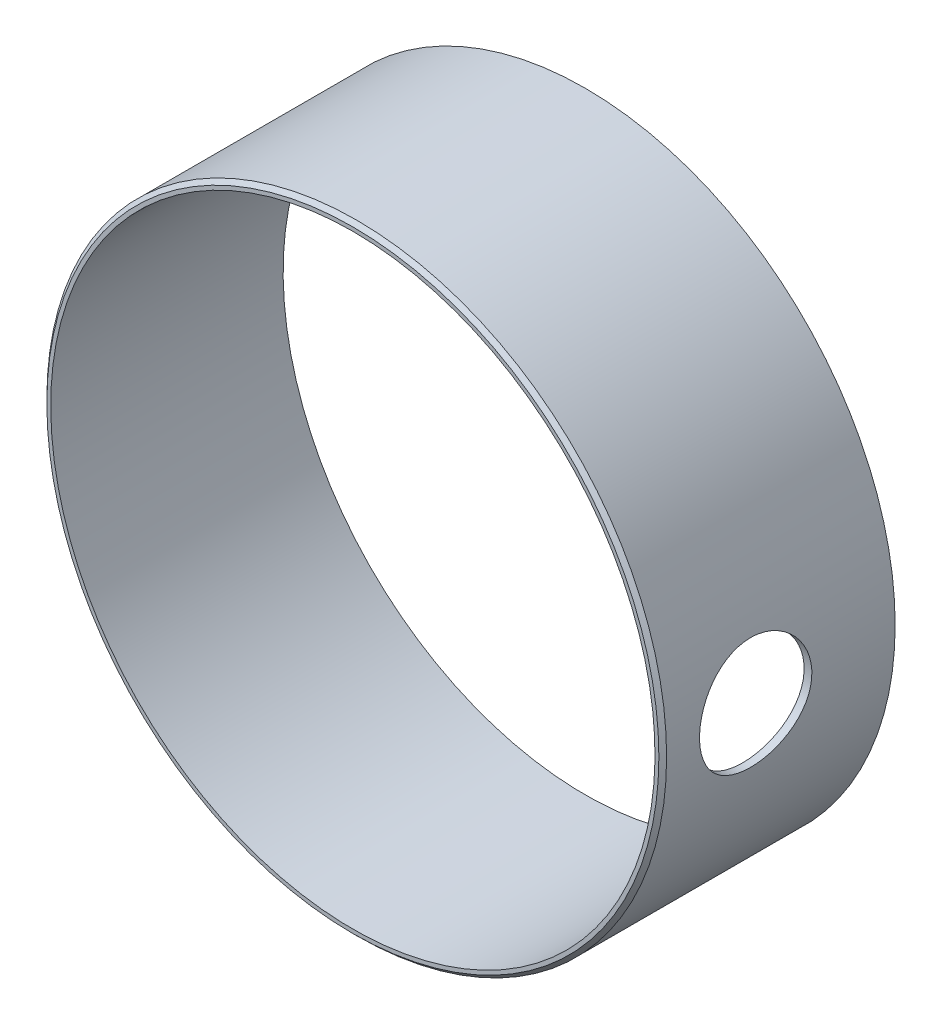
ISO-10303-21;
HEADER;
FILE_DESCRIPTION(('STEP AP214'),'2;1');
FILE_NAME('part.step','',(''),(''),'','','');
FILE_SCHEMA(('AUTOMOTIVE_DESIGN { 1 0 10303 214 1 1 1 1 }'));
ENDSEC;
DATA;
#1=APPLICATION_CONTEXT('core data for automotive mechanical design processes');
#2=APPLICATION_PROTOCOL_DEFINITION('international standard','automotive_design',2000,#1);
#3=PRODUCT_CONTEXT('',#1,'mechanical');
#4=PRODUCT('Part','Part','',(#3));
#5=PRODUCT_RELATED_PRODUCT_CATEGORY('part','',(#4));
#6=PRODUCT_DEFINITION_FORMATION('','',#4);
#7=PRODUCT_DEFINITION_CONTEXT('part definition',#1,'design');
#8=PRODUCT_DEFINITION('design','',#6,#7);
#9=PRODUCT_DEFINITION_SHAPE('','',#8);
#10=(LENGTH_UNIT() NAMED_UNIT(*) SI_UNIT(.MILLI.,.METRE.));
#11=(NAMED_UNIT(*) PLANE_ANGLE_UNIT() SI_UNIT($,.RADIAN.));
#12=(NAMED_UNIT(*) SI_UNIT($,.STERADIAN.) SOLID_ANGLE_UNIT());
#13=UNCERTAINTY_MEASURE_WITH_UNIT(LENGTH_MEASURE(1.E-05),#10,'distance_accuracy_value','');
#14=(GEOMETRIC_REPRESENTATION_CONTEXT(3) GLOBAL_UNCERTAINTY_ASSIGNED_CONTEXT((#13)) GLOBAL_UNIT_ASSIGNED_CONTEXT((#10,
#11,#12)) REPRESENTATION_CONTEXT('',''));
#15=CARTESIAN_POINT('',(0.,0.,0.));
#16=DIRECTION('',(0.,0.,1.));
#17=DIRECTION('',(1.,0.,0.));
#18=AXIS2_PLACEMENT_3D('',#15,#16,#17);
#19=CARTESIAN_POINT('',(0.,0.,0.));
#20=DIRECTION('',(0.,0.,-1.));
#21=DIRECTION('',(0.,1.,0.));
#22=AXIS2_PLACEMENT_3D('',#19,#20,#21);
#23=CYLINDRICAL_SURFACE('',#22,39.);
#24=CARTESIAN_POINT('',(38.3201970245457,7.25,18.));
#25=CARTESIAN_POINT('',(38.3201951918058,7.25000361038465,17.7982103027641));
#26=CARTESIAN_POINT('',(38.3217939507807,7.24157297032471,17.5964672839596));
#27=CARTESIAN_POINT('',(38.3281379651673,7.20792312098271,17.1943748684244));
#28=CARTESIAN_POINT('',(38.3328837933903,7.18270085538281,16.9940257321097));
#29=CARTESIAN_POINT('',(38.3453884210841,7.11564066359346,16.5961133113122));
#30=CARTESIAN_POINT('',(38.3531489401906,7.07379325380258,16.3985516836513));
#31=CARTESIAN_POINT('',(38.3714583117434,6.97379166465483,16.0076539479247));
#32=CARTESIAN_POINT('',(38.3820081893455,6.91563148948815,15.814319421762));
#33=CARTESIAN_POINT('',(38.40557336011,6.78354074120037,15.4335568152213));
#34=CARTESIAN_POINT('',(38.4185854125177,6.709630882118,15.2461213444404));
#35=CARTESIAN_POINT('',(38.4467164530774,6.54651369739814,14.8781122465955));
#36=CARTESIAN_POINT('',(38.4618362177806,6.45730073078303,14.6975411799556));
#37=CARTESIAN_POINT('',(38.4937435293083,6.26428509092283,14.3446391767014));
#38=CARTESIAN_POINT('',(38.5105302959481,6.16048923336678,14.1723044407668));
#39=CARTESIAN_POINT('',(38.5453145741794,5.93896411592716,13.8368740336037));
#40=CARTESIAN_POINT('',(38.5633125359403,5.82122966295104,13.6737818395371));
#41=CARTESIAN_POINT('',(38.6002099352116,5.57134693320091,13.3563127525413));
#42=CARTESIAN_POINT('',(38.6191169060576,5.43905909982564,13.2020465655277));
#43=CARTESIAN_POINT('',(38.657129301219,5.16196783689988,12.9051162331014));
#44=CARTESIAN_POINT('',(38.6762347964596,5.0171597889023,12.7624564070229));
#45=CARTESIAN_POINT('',(38.7140982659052,4.71610012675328,12.4898158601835));
#46=CARTESIAN_POINT('',(38.7328563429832,4.55985197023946,12.359831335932));
#47=CARTESIAN_POINT('',(38.7695155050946,4.23687230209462,12.1133459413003));
#48=CARTESIAN_POINT('',(38.787416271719,4.0701369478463,11.996850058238));
#49=CARTESIAN_POINT('',(38.8219808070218,3.72611128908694,11.7774182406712));
#50=CARTESIAN_POINT('',(38.8386345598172,3.5487526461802,11.6745878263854));
#51=CARTESIAN_POINT('',(38.8700866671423,3.18583310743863,11.4842535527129));
#52=CARTESIAN_POINT('',(38.8848850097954,3.00027215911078,11.3967497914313));
#53=CARTESIAN_POINT('',(38.9122035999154,2.62227209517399,11.2377350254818));
#54=CARTESIAN_POINT('',(38.9247240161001,2.42983349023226,11.1662228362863));
#55=CARTESIAN_POINT('',(38.9471295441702,2.03944196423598,11.0397358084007));
#56=CARTESIAN_POINT('',(38.9570146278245,1.84148898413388,10.9847611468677));
#57=CARTESIAN_POINT('',(38.9737664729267,1.44383634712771,10.8923268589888));
#58=CARTESIAN_POINT('',(38.9806669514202,1.24418366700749,10.8546712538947));
#59=CARTESIAN_POINT('',(38.9914222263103,0.842274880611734,10.7962280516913));
#60=CARTESIAN_POINT('',(38.9952759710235,0.640017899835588,10.77544627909));
#61=CARTESIAN_POINT('',(38.9998212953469,0.234511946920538,10.7509502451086));
#62=CARTESIAN_POINT('',(39.0005142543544,0.0312634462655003,10.7472285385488));
#63=CARTESIAN_POINT('',(38.9987290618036,-0.374836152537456,10.7568424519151));
#64=CARTESIAN_POINT('',(38.9962497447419,-0.577687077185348,10.7701843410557));
#65=CARTESIAN_POINT('',(38.9842252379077,-1.17827816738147,10.8351865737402));
#66=CARTESIAN_POINT('',(38.9701517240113,-1.57355865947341,10.9115022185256));
#67=CARTESIAN_POINT('',(38.9313367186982,-2.34538232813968,11.1281288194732));
#68=CARTESIAN_POINT('',(38.9065948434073,-2.72192482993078,11.2684420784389));
#69=CARTESIAN_POINT('',(38.8489741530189,-3.44828538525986,11.6098770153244));
#70=CARTESIAN_POINT('',(38.8160508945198,-3.79794334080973,11.811332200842));
#71=CARTESIAN_POINT('',(38.7457078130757,-4.45878641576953,12.2690866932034));
#72=CARTESIAN_POINT('',(38.7082875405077,-4.76996768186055,12.5253914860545));
#73=CARTESIAN_POINT('',(38.6324313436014,-5.34997432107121,13.0901581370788));
#74=CARTESIAN_POINT('',(38.5939886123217,-5.6180904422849,13.3993480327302));
#75=CARTESIAN_POINT('',(38.5209598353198,-6.09876604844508,14.0586806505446));
#76=CARTESIAN_POINT('',(38.4863738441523,-6.31132474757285,14.4088239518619));
#77=CARTESIAN_POINT('',(38.4249651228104,-6.67505038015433,15.14105500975));
#78=CARTESIAN_POINT('',(38.3981552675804,-6.82611566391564,15.5231944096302));
#79=CARTESIAN_POINT('',(38.3555326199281,-7.06169898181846,16.3080402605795));
#80=CARTESIAN_POINT('',(38.3397186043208,-7.14622441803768,16.710744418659));
#81=CARTESIAN_POINT('',(38.3211197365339,-7.24529615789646,17.5188962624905));
#82=CARTESIAN_POINT('',(38.3181452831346,-7.26086089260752,17.9242148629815));
#83=CARTESIAN_POINT('',(38.3250551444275,-7.22429800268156,18.7316599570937));
#84=CARTESIAN_POINT('',(38.3349388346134,-7.1721736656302,19.1337866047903));
#85=CARTESIAN_POINT('',(38.3662748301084,-7.00258646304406,19.9200937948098));
#86=CARTESIAN_POINT('',(38.3876327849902,-6.88565623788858,20.3043933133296));
#87=CARTESIAN_POINT('',(38.4394297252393,-6.5903396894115,21.0479457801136));
#88=CARTESIAN_POINT('',(38.4698693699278,-6.41194890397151,21.4071969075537));
#89=CARTESIAN_POINT('',(38.5368322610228,-5.99643157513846,22.0949437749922));
#90=CARTESIAN_POINT('',(38.5734206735,-5.7586609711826,22.4230438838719));
#91=CARTESIAN_POINT('',(38.6483750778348,-5.23198327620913,23.035060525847));
#92=CARTESIAN_POINT('',(38.6867412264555,-4.94307166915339,23.318973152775));
#93=CARTESIAN_POINT('',(38.7615349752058,-4.31784235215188,23.8383339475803));
#94=CARTESIAN_POINT('',(38.7979305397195,-3.98095243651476,24.0730974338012));
#95=CARTESIAN_POINT('',(38.864152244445,-3.27169519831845,24.4827419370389));
#96=CARTESIAN_POINT('',(38.8939786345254,-2.89932922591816,24.6576252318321));
#97=CARTESIAN_POINT('',(38.9311948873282,-2.32361083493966,24.8705999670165));
#98=CARTESIAN_POINT('',(38.9423311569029,-2.12926115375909,24.9332877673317));
#99=CARTESIAN_POINT('',(38.9618460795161,-1.73586099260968,25.0420773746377));
#100=CARTESIAN_POINT('',(38.9702257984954,-1.53681236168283,25.0881855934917));
#101=CARTESIAN_POINT('',(38.9839873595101,-1.13538728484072,25.1634581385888));
#102=CARTESIAN_POINT('',(38.9893683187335,-0.933009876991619,25.1926174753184));
#103=CARTESIAN_POINT('',(38.9969749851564,-0.526530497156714,25.2337383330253));
#104=CARTESIAN_POINT('',(38.9992019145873,-0.32242922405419,25.2457065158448));
#105=CARTESIAN_POINT('',(39.0004308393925,0.0830569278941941,25.2523178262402));
#106=CARTESIAN_POINT('',(38.9994797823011,0.284437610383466,25.2472131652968));
#107=CARTESIAN_POINT('',(38.9944835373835,0.68596730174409,25.2202784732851));
#108=CARTESIAN_POINT('',(38.9904394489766,0.886116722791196,25.1984543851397));
#109=CARTESIAN_POINT('',(38.9793700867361,1.28386045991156,25.1382537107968));
#110=CARTESIAN_POINT('',(38.9723443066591,1.48145433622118,25.0998743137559));
#111=CARTESIAN_POINT('',(38.9555067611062,1.87265179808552,25.0068606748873));
#112=CARTESIAN_POINT('',(38.9456950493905,2.0662554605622,24.9522267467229));
#113=CARTESIAN_POINT('',(38.9235756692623,2.44779791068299,24.8272261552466));
#114=CARTESIAN_POINT('',(38.9112723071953,2.63574583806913,24.7568866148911));
#115=CARTESIAN_POINT('',(38.8844961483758,3.00503517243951,24.6009421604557));
#116=CARTESIAN_POINT('',(38.8700233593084,3.18637660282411,24.5153373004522));
#117=CARTESIAN_POINT('',(38.8392987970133,3.54127157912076,24.3294573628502));
#118=CARTESIAN_POINT('',(38.8230466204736,3.71482334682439,24.2291789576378));
#119=CARTESIAN_POINT('',(38.7892125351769,4.05288086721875,24.0147081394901));
#120=CARTESIAN_POINT('',(38.77163108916,4.21738973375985,23.9005205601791));
#121=CARTESIAN_POINT('',(38.7353476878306,4.53865083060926,23.6572370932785));
#122=CARTESIAN_POINT('',(38.7166332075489,4.69525653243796,23.5279495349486));
#123=CARTESIAN_POINT('',(38.6788460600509,4.99699753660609,23.2567716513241));
#124=CARTESIAN_POINT('',(38.6597735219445,5.14213687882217,23.1148858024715));
#125=CARTESIAN_POINT('',(38.6217831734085,5.42010695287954,22.8193482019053));
#126=CARTESIAN_POINT('',(38.6028654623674,5.55293026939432,22.6656894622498));
#127=CARTESIAN_POINT('',(38.5657332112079,5.80521124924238,22.3477794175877));
#128=CARTESIAN_POINT('',(38.5475184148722,5.92467381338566,22.1835320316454));
#129=CARTESIAN_POINT('',(38.512131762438,6.15052042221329,21.8439014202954));
#130=CARTESIAN_POINT('',(38.4949714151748,6.2567699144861,21.6684274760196));
#131=CARTESIAN_POINT('',(38.46238830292,6.45404379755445,21.3090516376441));
#132=CARTESIAN_POINT('',(38.4469648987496,6.5450737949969,21.1251528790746));
#133=CARTESIAN_POINT('',(38.4183109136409,6.71122185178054,20.7502727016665));
#134=CARTESIAN_POINT('',(38.4050789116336,6.78635023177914,20.5592959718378));
#135=CARTESIAN_POINT('',(38.3811906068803,6.92017425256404,20.1715799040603));
#136=CARTESIAN_POINT('',(38.3705337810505,6.97887323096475,19.974841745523));
#137=CARTESIAN_POINT('',(38.347917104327,7.10231658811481,19.4861977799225));
#138=CARTESIAN_POINT('',(38.3375764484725,7.15762650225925,19.19177881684));
#139=CARTESIAN_POINT('',(38.3237178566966,7.23146504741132,18.5982056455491));
#140=CARTESIAN_POINT('',(38.3201997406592,7.2499946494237,18.2990515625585));
#141=CARTESIAN_POINT('',(38.3201970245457,7.25,18.));
#142=B_SPLINE_CURVE_WITH_KNOTS('',3,(#24,#25,#26,#27,#28,#29,#30,#31,#32,#33,#34,#35,#36,#37,
#38,#39,#40,#41,#42,#43,#44,#45,#46,#47,#48,#49,#50,#51,#52,#53,#54,#55,#56,#57,#58,#59,#60,#61,
#62,#63,#64,#65,#66,#67,#68,#69,#70,#71,#72,#73,#74,#75,#76,#77,#78,#79,#80,#81,#82,#83,#84,#85,
#86,#87,#88,#89,#90,#91,#92,#93,#94,#95,#96,#97,#98,#99,#100,#101,#102,#103,#104,#105,#106,#107,
#108,#109,#110,#111,#112,#113,#114,#115,#116,#117,#118,#119,#120,#121,#122,#123,#124,#125,#126,
#127,#128,#129,#130,#131,#132,#133,#134,#135,#136,#137,#138,#139,#140,#141),.UNSPECIFIED.,.T.,
.F.,(4,2,2,2,2,2,2,2,2,2,2,2,2,2,2,2,2,2,2,2,2,2,2,2,2,2,2,2,2,2,2,2,2,2,2,2,2,2,2,2,2,2,2,2,2,
2,2,2,2,2,2,2,2,2,2,2,2,2,4),(0.,0.605106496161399,1.21032316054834,1.81588555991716,
2.42167082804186,3.02666422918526,3.63188112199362,4.23681608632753,4.84197714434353,
5.45355284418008,6.06535511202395,6.6769732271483,7.28881676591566,7.90513977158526,
8.52146672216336,9.13774800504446,9.75403588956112,10.3631671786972,10.9725086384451,
11.5815841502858,12.1908835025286,13.393159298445,14.5954783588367,15.8044772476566,
17.0135971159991,18.2409449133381,19.4683100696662,20.6976959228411,21.9269449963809,
23.1379783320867,24.3489528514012,25.5501188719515,26.7513721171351,27.9662681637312,
29.1812715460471,30.4122148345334,31.6431112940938,32.2560386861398,32.8687287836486,
33.4815991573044,34.0942319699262,34.6978547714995,35.3012631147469,35.9047739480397,
36.5082731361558,37.110738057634,37.7132008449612,38.3158004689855,38.9181912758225,
39.5292912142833,40.1401748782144,40.751423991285,41.3624481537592,41.9792581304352,
42.5958403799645,43.2120212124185,43.8280767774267,44.7248659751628,45.6216314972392),.UNSPECIFIED.);
#143=CARTESIAN_POINT('',(38.3201970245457,7.25,18.));
#144=VERTEX_POINT('',#143);
#145=EDGE_CURVE('E48',#144,#144,#142,.T.);
#146=ORIENTED_EDGE('',*,*,#145,.F.);
#147=EDGE_LOOP('',(#146));
#148=FACE_BOUND('',#147,.T.);
#149=CARTESIAN_POINT('',(0.,0.,0.));
#150=DIRECTION('',(0.,0.,-1.));
#151=DIRECTION('',(0.,1.,0.));
#152=AXIS2_PLACEMENT_3D('',#149,#150,#151);
#153=CIRCLE('',#152,39.);
#154=CARTESIAN_POINT('',(0.,39.,0.));
#155=VERTEX_POINT('',#154);
#156=EDGE_CURVE('E54',#155,#155,#153,.T.);
#157=ORIENTED_EDGE('',*,*,#156,.T.);
#158=EDGE_LOOP('',(#157));
#159=FACE_BOUND('',#158,.T.);
#160=CARTESIAN_POINT('',(0.,0.,30.));
#161=DIRECTION('',(0.,0.,-1.));
#162=DIRECTION('',(0.,1.,0.));
#163=AXIS2_PLACEMENT_3D('',#160,#161,#162);
#164=CIRCLE('',#163,39.);
#165=CARTESIAN_POINT('',(0.,39.,30.));
#166=VERTEX_POINT('',#165);
#167=EDGE_CURVE('E27',#166,#166,#164,.T.);
#168=ORIENTED_EDGE('',*,*,#167,.F.);
#169=EDGE_LOOP('',(#168));
#170=FACE_BOUND('',#169,.T.);
#171=ADVANCED_FACE('F12',(#148,#159,#170),#23,.F.);
#172=CARTESIAN_POINT('',(39.,0.,30.));
#173=DIRECTION('',(0.,0.,1.));
#174=DIRECTION('',(0.,-1.,0.));
#175=AXIS2_PLACEMENT_3D('',#172,#173,#174);
#176=PLANE('',#175);
#177=CARTESIAN_POINT('',(0.,0.,30.));
#178=DIRECTION('',(0.,0.,1.));
#179=DIRECTION('',(0.,-1.,0.));
#180=AXIS2_PLACEMENT_3D('',#177,#178,#179);
#181=CIRCLE('',#180,39.5);
#182=CARTESIAN_POINT('',(0.,-39.5,30.));
#183=VERTEX_POINT('',#182);
#184=EDGE_CURVE('E8',#183,#183,#181,.T.);
#185=ORIENTED_EDGE('',*,*,#184,.T.);
#186=EDGE_LOOP('',(#185));
#187=FACE_BOUND('',#186,.T.);
#188=ORIENTED_EDGE('',*,*,#167,.T.);
#189=EDGE_LOOP('',(#188));
#190=FACE_BOUND('',#189,.T.);
#191=ADVANCED_FACE('F63',(#187,#190),#176,.T.);
#192=CARTESIAN_POINT('',(0.,0.,0.));
#193=DIRECTION('',(0.,0.,-1.));
#194=DIRECTION('',(0.,1.,0.));
#195=AXIS2_PLACEMENT_3D('',#192,#193,#194);
#196=CYLINDRICAL_SURFACE('',#195,40.);
#197=CARTESIAN_POINT('',(0.,0.,29.5));
#198=DIRECTION('',(0.,0.,1.));
#199=DIRECTION('',(0.,-1.,0.));
#200=AXIS2_PLACEMENT_3D('',#197,#198,#199);
#201=CIRCLE('',#200,40.);
#202=CARTESIAN_POINT('',(0.,-40.,29.5));
#203=VERTEX_POINT('',#202);
#204=EDGE_CURVE('E19',#203,#203,#201,.F.);
#205=ORIENTED_EDGE('',*,*,#204,.T.);
#206=EDGE_LOOP('',(#205));
#207=FACE_BOUND('',#206,.T.);
#208=CARTESIAN_POINT('',(39.3374821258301,7.25,18.));
#209=CARTESIAN_POINT('',(39.3374804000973,7.25000348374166,18.2018840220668));
#210=CARTESIAN_POINT('',(39.3390392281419,7.24156503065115,18.4037225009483));
#211=CARTESIAN_POINT('',(39.3452250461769,7.20788325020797,18.806006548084));
#212=CARTESIAN_POINT('',(39.3498526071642,7.18263679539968,19.0064518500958));
#213=CARTESIAN_POINT('',(39.3620459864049,7.11551062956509,19.4045604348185));
#214=CARTESIAN_POINT('',(39.3696135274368,7.07362116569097,19.602222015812));
#215=CARTESIAN_POINT('',(39.3874681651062,6.97351673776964,19.9933192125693));
#216=CARTESIAN_POINT('',(39.3977562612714,6.91529577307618,20.1867532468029));
#217=CARTESIAN_POINT('',(39.4207376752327,6.78306228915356,20.5677169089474));
#218=CARTESIAN_POINT('',(39.4334278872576,6.70907014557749,20.7552538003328));
#219=CARTESIAN_POINT('',(39.4608639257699,6.54576743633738,21.1234604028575));
#220=CARTESIAN_POINT('',(39.4756105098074,6.45645122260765,21.3041275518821));
#221=CARTESIAN_POINT('',(39.5067308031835,6.26320917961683,21.6572113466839));
#222=CARTESIAN_POINT('',(39.5231037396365,6.1592902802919,21.8296318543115));
#223=CARTESIAN_POINT('',(39.5570307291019,5.9374998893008,22.1652207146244));
#224=CARTESIAN_POINT('',(39.5745852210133,5.81962320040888,22.3283855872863));
#225=CARTESIAN_POINT('',(39.6105634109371,5.56950484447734,22.6458980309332));
#226=CARTESIAN_POINT('',(39.6289940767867,5.43713059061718,22.8001403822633));
#227=CARTESIAN_POINT('',(39.6660478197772,5.15986571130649,23.0970142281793));
#228=CARTESIAN_POINT('',(39.6846709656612,5.01497046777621,23.2396414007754));
#229=CARTESIAN_POINT('',(39.7215770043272,4.71373876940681,23.512205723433));
#230=CARTESIAN_POINT('',(39.7398599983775,4.55740579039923,23.6421467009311));
#231=CARTESIAN_POINT('',(39.7755887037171,4.2342617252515,23.8885333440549));
#232=CARTESIAN_POINT('',(39.7930341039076,4.067446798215,24.0049740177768));
#233=CARTESIAN_POINT('',(39.8267103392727,3.72333597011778,24.2242412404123));
#234=CARTESIAN_POINT('',(39.8429319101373,3.54597539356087,24.3269677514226));
#235=CARTESIAN_POINT('',(39.8735655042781,3.18306911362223,24.5170954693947));
#236=CARTESIAN_POINT('',(39.8879775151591,2.99752335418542,24.6044965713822));
#237=CARTESIAN_POINT('',(39.9145804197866,2.61957083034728,24.7633100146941));
#238=CARTESIAN_POINT('',(39.9267714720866,2.42716455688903,24.8347234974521));
#239=CARTESIAN_POINT('',(39.9485847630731,2.03685451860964,24.9610198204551));
#240=CARTESIAN_POINT('',(39.9582069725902,1.83895069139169,25.0159024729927));
#241=CARTESIAN_POINT('',(39.9745144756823,1.44130034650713,25.1081889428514));
#242=CARTESIAN_POINT('',(39.9812310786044,1.24159842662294,25.1457793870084));
#243=CARTESIAN_POINT('',(39.9916931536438,0.839600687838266,25.2040850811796));
#244=CARTESIAN_POINT('',(39.9954375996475,0.637303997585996,25.2247945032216));
#245=CARTESIAN_POINT('',(39.9998421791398,0.231726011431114,25.2491402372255));
#246=CARTESIAN_POINT('',(40.0005036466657,0.0284451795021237,25.2527839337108));
#247=CARTESIAN_POINT('',(39.9987339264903,-0.377712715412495,25.243008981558));
#248=CARTESIAN_POINT('',(39.9963016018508,-0.580589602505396,25.229584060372));
#249=CARTESIAN_POINT('',(39.9845276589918,-1.18149599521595,25.1643009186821));
#250=CARTESIAN_POINT('',(39.9707629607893,-1.57705523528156,25.0877393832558));
#251=CARTESIAN_POINT('',(39.9328225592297,-2.34939622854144,24.8705190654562));
#252=CARTESIAN_POINT('',(39.9086464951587,-2.72617733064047,24.7298580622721));
#253=CARTESIAN_POINT('',(39.8523681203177,-3.45286395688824,24.3876665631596));
#254=CARTESIAN_POINT('',(39.8202243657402,-3.80261599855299,24.1858165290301));
#255=CARTESIAN_POINT('',(39.7515686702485,-4.46356529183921,23.7272119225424));
#256=CARTESIAN_POINT('',(39.7150563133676,-4.77475886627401,23.4704521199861));
#257=CARTESIAN_POINT('',(39.6410955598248,-5.35446526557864,22.9049442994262));
#258=CARTESIAN_POINT('',(39.6036412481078,-5.62230228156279,22.5955037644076));
#259=CARTESIAN_POINT('',(39.5325199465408,-6.10237219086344,21.9357334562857));
#260=CARTESIAN_POINT('',(39.498853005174,-6.31460437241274,21.5854031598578));
#261=CARTESIAN_POINT('',(39.4391113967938,-6.67761547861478,20.8529369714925));
#262=CARTESIAN_POINT('',(39.4130482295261,-6.82830145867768,20.4707540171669));
#263=CARTESIAN_POINT('',(39.3716452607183,-7.06313732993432,19.6859187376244));
#264=CARTESIAN_POINT('',(39.3563043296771,-7.1472942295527,19.2832685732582));
#265=CARTESIAN_POINT('',(39.3383047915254,-7.24570736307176,18.475008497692));
#266=CARTESIAN_POINT('',(39.3354704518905,-7.26093225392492,18.0695203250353));
#267=CARTESIAN_POINT('',(39.3423354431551,-7.22364090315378,17.261794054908));
#268=CARTESIAN_POINT('',(39.3520341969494,-7.1711277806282,16.8595558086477));
#269=CARTESIAN_POINT('',(39.3827092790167,-7.00068127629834,16.0728984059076));
#270=CARTESIAN_POINT('',(39.4035988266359,-6.88325108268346,15.688366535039));
#271=CARTESIAN_POINT('',(39.4542276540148,-6.58683440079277,14.9444370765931));
#272=CARTESIAN_POINT('',(39.4839675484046,-6.40784363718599,14.5850412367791));
#273=CARTESIAN_POINT('',(39.5493487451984,-5.99114492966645,13.8973060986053));
#274=CARTESIAN_POINT('',(39.5850504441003,-5.75282236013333,13.5693450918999));
#275=CARTESIAN_POINT('',(39.6581610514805,-5.2250386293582,12.957716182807));
#276=CARTESIAN_POINT('',(39.6955701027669,-4.93557318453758,12.6740519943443));
#277=CARTESIAN_POINT('',(39.768440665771,-4.30947987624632,12.1554949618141));
#278=CARTESIAN_POINT('',(39.8038721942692,-3.97231057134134,11.9212520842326));
#279=CARTESIAN_POINT('',(39.8683051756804,-3.2626153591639,11.512688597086));
#280=CARTESIAN_POINT('',(39.8973068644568,-2.89009074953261,11.3383657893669));
#281=CARTESIAN_POINT('',(39.9334649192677,-2.31419662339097,11.1262238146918));
#282=CARTESIAN_POINT('',(39.9442794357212,-2.11977936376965,11.063808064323));
#283=CARTESIAN_POINT('',(39.9632162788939,-1.72627429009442,10.9555670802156));
#284=CARTESIAN_POINT('',(39.9713396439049,-1.52718830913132,10.9097354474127));
#285=CARTESIAN_POINT('',(39.9846613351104,-1.12571716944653,10.8350166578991));
#286=CARTESIAN_POINT('',(39.9898587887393,-0.923331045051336,10.8061345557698));
#287=CARTESIAN_POINT('',(39.9971766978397,-0.516861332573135,10.7655652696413));
#288=CARTESIAN_POINT('',(39.9992983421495,-0.31277843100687,10.7538714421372));
#289=CARTESIAN_POINT('',(40.0003992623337,0.0927985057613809,10.7477970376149));
#290=CARTESIAN_POINT('',(39.999422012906,0.294288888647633,10.7531769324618));
#291=CARTESIAN_POINT('',(39.9944483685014,0.696014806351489,10.7806798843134));
#292=CARTESIAN_POINT('',(39.9904530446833,0.896250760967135,10.8027970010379));
#293=CARTESIAN_POINT('',(39.9795548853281,1.29414456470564,10.8636002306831));
#294=CARTESIAN_POINT('',(39.9726515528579,1.49180196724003,10.9022891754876));
#295=CARTESIAN_POINT('',(39.9561293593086,1.88310275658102,10.9959372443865));
#296=CARTESIAN_POINT('',(39.9465105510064,2.07674622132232,11.0508960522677));
#297=CARTESIAN_POINT('',(39.9248402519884,2.45837461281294,11.176570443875));
#298=CARTESIAN_POINT('',(39.912792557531,2.64636785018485,11.2472614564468));
#299=CARTESIAN_POINT('',(39.886585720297,3.01571890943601,11.4039268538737));
#300=CARTESIAN_POINT('',(39.8724265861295,3.1970767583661,11.4899011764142));
#301=CARTESIAN_POINT('',(39.8423796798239,3.55197221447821,11.6765358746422));
#302=CARTESIAN_POINT('',(39.82649152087,3.72550805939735,11.7771995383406));
#303=CARTESIAN_POINT('',(39.7934267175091,4.06349827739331,11.9924537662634));
#304=CARTESIAN_POINT('',(39.7762505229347,4.22795578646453,12.1070394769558));
#305=CARTESIAN_POINT('',(39.7408267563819,4.5489699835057,12.351055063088));
#306=CARTESIAN_POINT('',(39.7225676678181,4.70538626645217,12.4806680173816));
#307=CARTESIAN_POINT('',(39.6857126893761,5.00672013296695,12.7524852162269));
#308=CARTESIAN_POINT('',(39.6671169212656,5.15164177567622,12.8946849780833));
#309=CARTESIAN_POINT('',(39.6300892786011,5.42914689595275,13.1908351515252));
#310=CARTESIAN_POINT('',(39.6116575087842,5.56172293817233,13.3447925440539));
#311=CARTESIAN_POINT('',(39.5754927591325,5.81347958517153,13.663279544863));
#312=CARTESIAN_POINT('',(39.5577595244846,5.93266510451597,13.8278052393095));
#313=CARTESIAN_POINT('',(39.5233318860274,6.15786765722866,14.1678821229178));
#314=CARTESIAN_POINT('',(39.5066482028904,6.26375725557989,14.343518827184));
#315=CARTESIAN_POINT('',(39.4749849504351,6.4602996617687,14.7031815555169));
#316=CARTESIAN_POINT('',(39.4600047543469,6.55095807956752,14.8872044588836));
#317=CARTESIAN_POINT('',(39.4321901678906,6.7163543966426,15.2622896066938));
#318=CARTESIAN_POINT('',(39.4193543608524,6.79110281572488,15.4533471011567));
#319=CARTESIAN_POINT('',(39.396198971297,6.92416433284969,15.8411829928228));
#320=CARTESIAN_POINT('',(39.3858788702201,6.98248081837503,16.0379602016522));
#321=CARTESIAN_POINT('',(39.3640927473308,7.10448291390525,16.524632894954));
#322=CARTESIAN_POINT('',(39.354165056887,7.15898287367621,16.8169519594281));
#323=CARTESIAN_POINT('',(39.3408610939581,7.23173841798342,17.40621357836));
#324=CARTESIAN_POINT('',(39.3374846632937,7.24999487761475,17.7031560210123));
#325=CARTESIAN_POINT('',(39.3374821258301,7.25,18.));
#326=B_SPLINE_CURVE_WITH_KNOTS('',3,(#208,#209,#210,#211,#212,#213,#214,#215,#216,#217,#218,
#219,#220,#221,#222,#223,#224,#225,#226,#227,#228,#229,#230,#231,#232,#233,#234,#235,#236,#237,
#238,#239,#240,#241,#242,#243,#244,#245,#246,#247,#248,#249,#250,#251,#252,#253,#254,#255,#256,
#257,#258,#259,#260,#261,#262,#263,#264,#265,#266,#267,#268,#269,#270,#271,#272,#273,#274,#275,
#276,#277,#278,#279,#280,#281,#282,#283,#284,#285,#286,#287,#288,#289,#290,#291,#292,#293,#294,
#295,#296,#297,#298,#299,#300,#301,#302,#303,#304,#305,#306,#307,#308,#309,#310,#311,#312,#313,
#314,#315,#316,#317,#318,#319,#320,#321,#322,#323,#324,#325),.UNSPECIFIED.,.T.,.F.,(4,2,2,2,2,2,
2,2,2,2,2,2,2,2,2,2,2,2,2,2,2,2,2,2,2,2,2,2,2,2,2,2,2,2,2,2,2,2,2,2,2,2,2,2,2,2,2,2,2,2,2,2,2,2,
2,2,2,2,4),(0.,0.605391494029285,1.2108956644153,1.81675518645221,2.4228376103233,
3.02814169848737,3.63366936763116,4.23891063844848,4.8443779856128,5.45593657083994,
6.06772168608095,6.67932165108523,7.29114704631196,7.90721640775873,8.52328998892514,
9.13931957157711,9.75535614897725,10.3645784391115,10.9740109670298,11.5831797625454,
12.1925724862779,13.3957709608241,14.5990111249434,15.8086463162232,17.0183967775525,
18.2454897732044,19.4725984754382,20.7015535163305,21.9303790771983,23.1418820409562,
24.353329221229,25.5555152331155,26.7577847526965,27.9730685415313,29.1884541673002,
30.4189451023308,31.6493908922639,32.2622104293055,32.8747932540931,33.487558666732,
34.1000871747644,34.7040606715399,35.3078199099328,35.9116823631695,36.5155330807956,
37.1184472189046,37.7213588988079,38.3244057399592,38.9272429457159,39.5384019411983,
40.1493441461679,40.7606519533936,41.3717346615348,41.9882877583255,42.604613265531,
43.2205299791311,43.83631962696,44.7264899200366,45.6166387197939),.UNSPECIFIED.);
#327=CARTESIAN_POINT('',(39.3374821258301,7.25,18.));
#328=VERTEX_POINT('',#327);
#329=EDGE_CURVE('E23',#328,#328,#326,.T.);
#330=ORIENTED_EDGE('',*,*,#329,.F.);
#331=EDGE_LOOP('',(#330));
#332=FACE_BOUND('',#331,.T.);
#333=CARTESIAN_POINT('',(0.,0.,0.));
#334=DIRECTION('',(0.,0.,-1.));
#335=DIRECTION('',(0.,1.,0.));
#336=AXIS2_PLACEMENT_3D('',#333,#334,#335);
#337=CIRCLE('',#336,40.);
#338=CARTESIAN_POINT('',(0.,40.,0.));
#339=VERTEX_POINT('',#338);
#340=EDGE_CURVE('E56',#339,#339,#337,.T.);
#341=ORIENTED_EDGE('',*,*,#340,.F.);
#342=EDGE_LOOP('',(#341));
#343=FACE_BOUND('',#342,.T.);
#344=ADVANCED_FACE('F36',(#207,#332,#343),#196,.T.);
#345=CARTESIAN_POINT('',(39.,0.,0.));
#346=DIRECTION('',(0.,0.,-1.));
#347=DIRECTION('',(0.,1.,0.));
#348=AXIS2_PLACEMENT_3D('',#345,#346,#347);
#349=PLANE('',#348);
#350=ORIENTED_EDGE('',*,*,#340,.T.);
#351=EDGE_LOOP('',(#350));
#352=FACE_BOUND('',#351,.T.);
#353=ORIENTED_EDGE('',*,*,#156,.F.);
#354=EDGE_LOOP('',(#353));
#355=FACE_BOUND('',#354,.T.);
#356=ADVANCED_FACE('F44',(#352,#355),#349,.T.);
#357=CARTESIAN_POINT('',(30.,0.,18.));
#358=DIRECTION('',(1.,0.,0.));
#359=DIRECTION('',(0.,1.,0.));
#360=AXIS2_PLACEMENT_3D('',#357,#358,#359);
#361=CYLINDRICAL_SURFACE('',#360,7.25);
#362=ORIENTED_EDGE('',*,*,#145,.T.);
#363=EDGE_LOOP('',(#362));
#364=FACE_BOUND('',#363,.T.);
#365=ORIENTED_EDGE('',*,*,#329,.T.);
#366=EDGE_LOOP('',(#365));
#367=FACE_BOUND('',#366,.T.);
#368=ADVANCED_FACE('F39',(#364,#367),#361,.F.);
#369=CARTESIAN_POINT('',(0.,0.,29.5));
#370=DIRECTION('',(0.,0.,-1.));
#371=DIRECTION('',(0.,1.,0.));
#372=AXIS2_PLACEMENT_3D('',#369,#370,#371);
#373=CONICAL_SURFACE('',#372,40.,0.785398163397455);
#374=ORIENTED_EDGE('',*,*,#184,.F.);
#375=EDGE_LOOP('',(#374));
#376=FACE_BOUND('',#375,.T.);
#377=ORIENTED_EDGE('',*,*,#204,.F.);
#378=EDGE_LOOP('',(#377));
#379=FACE_BOUND('',#378,.T.);
#380=ADVANCED_FACE('F43',(#376,#379),#373,.T.);
#381=CLOSED_SHELL('',(#171,#191,#344,#356,#368,#380));
#382=MANIFOLD_SOLID_BREP('B1',#381);
#383=ADVANCED_BREP_SHAPE_REPRESENTATION('',(#18,#382),#14);
#384=SHAPE_DEFINITION_REPRESENTATION(#9,#383);
ENDSEC;
END-ISO-10303-21;
